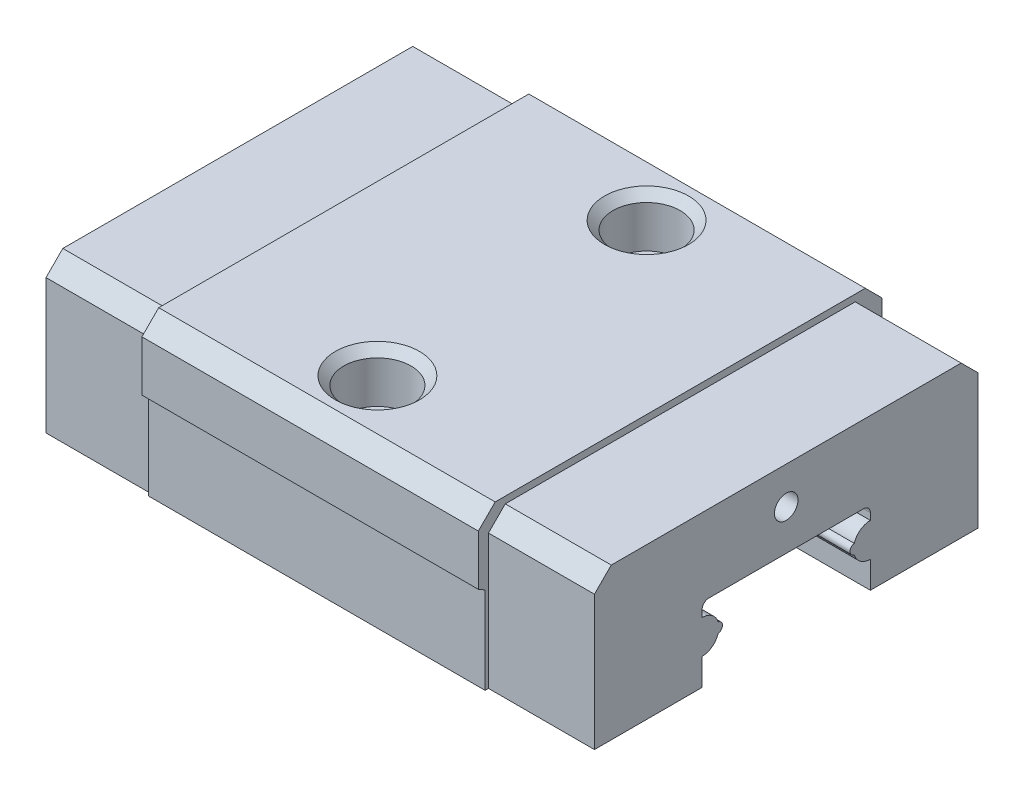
from build123d import *

# Parameters (mm, degrees)
EXTRUDE2_DEPTH                 = 25
EXTRUDE3_DEPTH                 = 5
EXTRUDE3_DEPTH_BACK            = 5
EXTRUDE4_DEPTH                 = 3.15
SKETCH_6_R                     = 0.35
CUT_EXTRUDE1_DEPTH             = 2
M2X0_4_TAPPED_HOLE1_AT_2_COUNT = 2
M2X0_4_TAPPED_HOLE1_AT_2_PITCH = 8
LPATTERN1_COUNT                = 2
LPATTERN1_PITCH                = 15
CUT_EXTRUDE4_DEPTH             = 21.035530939
CUT_EXTRUDE4_DEPTH_BACK        = 21.035530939
EXTRUDE1_DEPTH                 = 16.3
FILLET1_R                      = 0.2


with BuildPart() as part:
    # Sketch 1 → Extrude2 (new body)
    with BuildSketch(Plane(origin=(0, 0, 0), x_dir=(0, 0, -1), z_dir=(1, 0, 0))):
        Polygon((-2, 0), (-2.5, 0.5), (-2.5, 3.5), (2.5, 3.5), (2.5, 0.5), (2, 0), align=None)
    extrude(amount=-EXTRUDE2_DEPTH)

    # Sketch 2 → HoleWzd1 (revolve, cut)
    with BuildSketch(Plane(origin=(-5, 3.5, 0), x_dir=(0, 0, 1), z_dir=(1, 0, 0))):
        Polygon((0, 0), (0, 3.5), (1.4, 3.5), (1.2, 3.3), (1.2, 1), (1.75, 1), (1.75, 0.25), (2, 0), align=None)
    holewzd1 = revolve(axis=Axis((-5, 9.85, 0), (0, -1, 0)), mode=Mode.SUBTRACT)

    # Sketch 4 → Extrude3 (add, two sides: drawn at the far end of the back side and taken through both)
    with BuildSketch(Plane(origin=(-15, 0, 0), x_dir=(0, 0, -1), z_dir=(1, 0, 0)).offset(-EXTRUDE3_DEPTH_BACK)):
        Polygon((-5.5, 6), (-2.5, 6), (5.5, 6), (6, 5.5), (6, 4), (5.8, 3.884529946), (5.8, 1.3), (-5.8, 1.3), (-5.8, 3.884529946), (-6, 4), (-6, 5.5), align=None)
    extrude(amount=EXTRUDE3_DEPTH + EXTRUDE3_DEPTH_BACK)

    # Sketch 5 → Extrude4 (add)
    with BuildSketch(Plane.ZY.offset(20)):
        Polygon((-5.7, 1.3), (5.7, 1.3), (5.7, 5.3), (5.2, 5.8), (-5.2, 5.8), (-5.7, 5.3), align=None)
    extrude4 = extrude(amount=EXTRUDE4_DEPTH)

    # Sketch 6 → Cut-Extrude1 (cut)
    with BuildSketch(Plane.ZY.offset(23.15)):
        with Locations((0, 4.7)):
            Circle(SKETCH_6_R)
    cut_extrude1 = extrude(amount=-CUT_EXTRUDE1_DEPTH, mode=Mode.SUBTRACT)

    # Mirror1: Extrude4, Cut-Extrude1 across plane
    add(extrude4.mirror(Plane(origin=(-15, 0, 0), x_dir=(0, 0, 1), z_dir=(1, 0, 0))))
    add(cut_extrude1.mirror(Plane(origin=(-15, 0, 0), x_dir=(0, 0, 1), z_dir=(1, 0, 0))), mode=Mode.SUBTRACT)

    # Sketch 9 → M2x0.4 Tapped Hole1 (revolve, cut)
    with BuildSketch(Plane(origin=(-15, 6, -4), x_dir=(0, 0, 1), z_dir=(1, 0, 0))):
        Polygon((0, 0), (0, 2.980688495), (0.8, 2.5), (0.8, 1.5), (1, 1.5), (1, 0.25), (1.25, 0), align=None)
    m2x0_4_tapped_hole1 = revolve(axis=Axis((-15, 12.35, -4), (0, -1, 0)), mode=Mode.SUBTRACT)

    # M2x0.4 Tapped Hole1 at 2: M2x0.4 Tapped Hole1 ×2
    with Locations(*[(0, 0, i * M2X0_4_TAPPED_HOLE1_AT_2_PITCH) for i in range(1, M2X0_4_TAPPED_HOLE1_AT_2_COUNT)]):
        add(m2x0_4_tapped_hole1, mode=Mode.SUBTRACT)

    # LPattern1: HoleWzd1 ×2
    with Locations(*[(-i * LPATTERN1_PITCH, 0, 0) for i in range(1, LPATTERN1_COUNT)]):
        add(holewzd1, mode=Mode.SUBTRACT)

    # Sketch 11 → Cut-Extrude4 (cut, two sides: drawn at the far end of the back side and taken through both)
    with BuildSketch(Plane(origin=(-6.85, 0, 0), x_dir=(0, 0, -1), z_dir=(1, 0, 0)).offset(-CUT_EXTRUDE4_DEPTH_BACK)):
        Polygon((-2.5, 3.5), (-2.5, 0.5), (-2, 0), (2, 0), (2.5, 0.5), (2.5, 3.5), align=None)
    extrude(amount=CUT_EXTRUDE4_DEPTH + CUT_EXTRUDE4_DEPTH_BACK, mode=Mode.SUBTRACT)

    # Sketch1 → Extrude1 (add, through all)
    with BuildSketch(Plane(origin=(-6.85, 0, 0), x_dir=(0, 0, -1), z_dir=(1, 0, 0))):
        with BuildLine():
            ThreePointArc((2.022484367, 2.748252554), (1.895313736, 2.6), (2.022484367, 2.451747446))
            ThreePointArc((2.022484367, 2.451747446), (3, 2.6), (2.022484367, 2.748252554))
        make_face()
        with BuildLine():
            ThreePointArc((-2.022484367, 2.748252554), (-1.895313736, 2.6), (-2.022484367, 2.451747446))
            ThreePointArc((-2.022484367, 2.451747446), (-3, 2.6), (-2.022484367, 2.748252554))
        make_face()
    extrude(amount=-EXTRUDE1_DEPTH)

    # Fillet1
    fillet1_edges = [part.edges().sort_by_distance(p)[0] for p in [
        (-15, 3.5, -2.5),
        (-15, 3.5, 2.5),
    ]]
    fillet(fillet1_edges, radius=FILLET1_R)


solid = part.part
